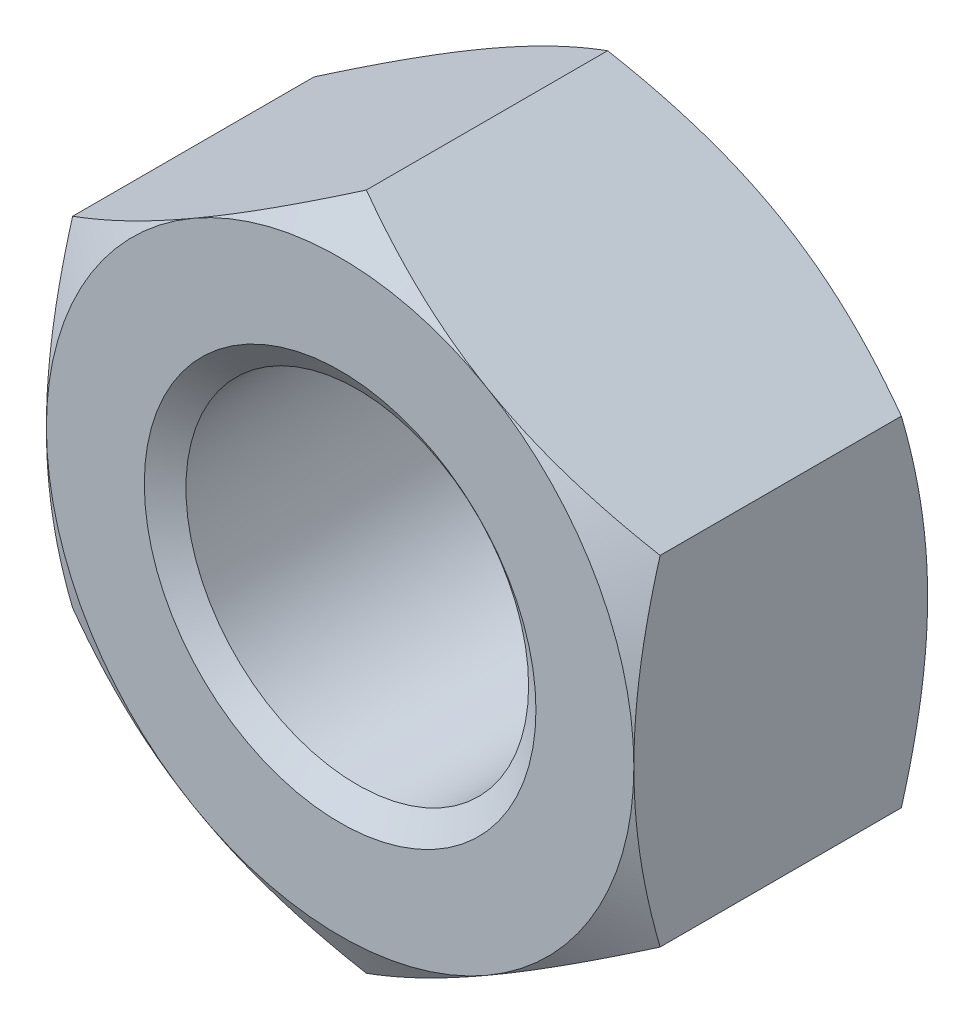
ISO-10303-21;
HEADER;
FILE_DESCRIPTION(('STEP AP214'),'2;1');
FILE_NAME('part.step','',(''),(''),'','','');
FILE_SCHEMA(('AUTOMOTIVE_DESIGN { 1 0 10303 214 1 1 1 1 }'));
ENDSEC;
DATA;
#1=APPLICATION_CONTEXT('core data for automotive mechanical design processes');
#2=APPLICATION_PROTOCOL_DEFINITION('international standard','automotive_design',2000,#1);
#3=PRODUCT_CONTEXT('',#1,'mechanical');
#4=PRODUCT('Part','Part','',(#3));
#5=PRODUCT_RELATED_PRODUCT_CATEGORY('part','',(#4));
#6=PRODUCT_DEFINITION_FORMATION('','',#4);
#7=PRODUCT_DEFINITION_CONTEXT('part definition',#1,'design');
#8=PRODUCT_DEFINITION('design','',#6,#7);
#9=PRODUCT_DEFINITION_SHAPE('','',#8);
#10=(LENGTH_UNIT() NAMED_UNIT(*) SI_UNIT(.MILLI.,.METRE.));
#11=(NAMED_UNIT(*) PLANE_ANGLE_UNIT() SI_UNIT($,.RADIAN.));
#12=(NAMED_UNIT(*) SI_UNIT($,.STERADIAN.) SOLID_ANGLE_UNIT());
#13=UNCERTAINTY_MEASURE_WITH_UNIT(LENGTH_MEASURE(1.E-05),#10,'distance_accuracy_value','');
#14=(GEOMETRIC_REPRESENTATION_CONTEXT(3) GLOBAL_UNCERTAINTY_ASSIGNED_CONTEXT((#13)) GLOBAL_UNIT_ASSIGNED_CONTEXT((#10,
#11,#12)) REPRESENTATION_CONTEXT('',''));
#15=CARTESIAN_POINT('',(0.,0.,0.));
#16=DIRECTION('',(0.,0.,1.));
#17=DIRECTION('',(1.,0.,0.));
#18=AXIS2_PLACEMENT_3D('',#15,#16,#17);
#19=CARTESIAN_POINT('',(0.,0.,-12.));
#20=DIRECTION('',(0.,0.,1.));
#21=DIRECTION('',(1.,0.,0.));
#22=AXIS2_PLACEMENT_3D('',#19,#20,#21);
#23=CYLINDRICAL_SURFACE('',#22,7.);
#24=CARTESIAN_POINT('',(0.,0.,-0.70020753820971));
#25=DIRECTION('',(0.,0.,1.));
#26=DIRECTION('',(1.,0.,0.));
#27=AXIS2_PLACEMENT_3D('',#24,#25,#26);
#28=CIRCLE('',#27,7.);
#29=CARTESIAN_POINT('',(7.,0.,-0.70020753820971));
#30=VERTEX_POINT('',#29);
#31=EDGE_CURVE('E173',#30,#30,#28,.F.);
#32=ORIENTED_EDGE('',*,*,#31,.F.);
#33=EDGE_LOOP('',(#32));
#34=FACE_BOUND('',#33,.T.);
#35=CARTESIAN_POINT('',(0.,0.,-11.2743924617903));
#36=DIRECTION('',(0.,0.,-1.));
#37=DIRECTION('',(-1.,0.,0.));
#38=AXIS2_PLACEMENT_3D('',#35,#36,#37);
#39=CIRCLE('',#38,7.);
#40=CARTESIAN_POINT('',(-7.,0.,-11.2743924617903));
#41=VERTEX_POINT('',#40);
#42=EDGE_CURVE('E37',#41,#41,#39,.F.);
#43=ORIENTED_EDGE('',*,*,#42,.F.);
#44=EDGE_LOOP('',(#43));
#45=FACE_BOUND('',#44,.T.);
#46=ADVANCED_FACE('F32',(#34,#45),#23,.F.);
#47=CARTESIAN_POINT('',(-24.,0.,-12.));
#48=DIRECTION('',(0.,0.,1.));
#49=DIRECTION('',(1.,0.,0.));
#50=AXIS2_PLACEMENT_3D('',#47,#48,#49);
#51=PLANE('',#50);
#52=CARTESIAN_POINT('',(0.,0.,-12.));
#53=DIRECTION('',(0.,0.,1.));
#54=DIRECTION('',(1.,0.,0.));
#55=AXIS2_PLACEMENT_3D('',#52,#53,#54);
#56=CIRCLE('',#55,12.);
#57=CARTESIAN_POINT('',(12.,0.,-12.));
#58=VERTEX_POINT('',#57);
#59=CARTESIAN_POINT('',(6.,10.3923048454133,-12.));
#60=VERTEX_POINT('',#59);
#61=EDGE_CURVE('E243',#58,#60,#56,.T.);
#62=ORIENTED_EDGE('',*,*,#61,.F.);
#63=CARTESIAN_POINT('',(0.,0.,-12.));
#64=DIRECTION('',(0.,0.,1.));
#65=DIRECTION('',(1.,0.,0.));
#66=AXIS2_PLACEMENT_3D('',#63,#64,#65);
#67=CIRCLE('',#66,12.);
#68=CARTESIAN_POINT('',(6.,-10.3923048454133,-12.));
#69=VERTEX_POINT('',#68);
#70=EDGE_CURVE('E167',#58,#69,#67,.F.);
#71=ORIENTED_EDGE('',*,*,#70,.T.);
#72=CARTESIAN_POINT('',(-6.,-10.3923048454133,-12.));
#73=VERTEX_POINT('',#72);
#74=EDGE_CURVE('E169',#69,#73,#67,.F.);
#75=ORIENTED_EDGE('',*,*,#74,.T.);
#76=CARTESIAN_POINT('',(-12.,0.,-12.));
#77=VERTEX_POINT('',#76);
#78=EDGE_CURVE('E400',#73,#77,#67,.F.);
#79=ORIENTED_EDGE('',*,*,#78,.T.);
#80=CARTESIAN_POINT('',(-6.00000000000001,10.3923048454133,-12.));
#81=VERTEX_POINT('',#80);
#82=EDGE_CURVE('E402',#77,#81,#67,.F.);
#83=ORIENTED_EDGE('',*,*,#82,.T.);
#84=EDGE_CURVE('E151',#81,#60,#67,.F.);
#85=ORIENTED_EDGE('',*,*,#84,.T.);
#86=EDGE_LOOP('',(#62,#71,#75,#79,#83,#85));
#87=FACE_BOUND('',#86,.T.);
#88=CARTESIAN_POINT('',(0.,0.,-12.));
#89=DIRECTION('',(0.,0.,1.));
#90=DIRECTION('',(1.,0.,0.));
#91=AXIS2_PLACEMENT_3D('',#88,#89,#90);
#92=CIRCLE('',#91,8.);
#93=CARTESIAN_POINT('',(8.,0.,-12.));
#94=VERTEX_POINT('',#93);
#95=EDGE_CURVE('E176',#94,#94,#92,.F.);
#96=ORIENTED_EDGE('',*,*,#95,.F.);
#97=EDGE_LOOP('',(#96));
#98=FACE_BOUND('',#97,.T.);
#99=ADVANCED_FACE('F295',(#87,#98),#51,.F.);
#100=CARTESIAN_POINT('',(-24.,0.,0.));
#101=DIRECTION('',(0.,0.,1.));
#102=DIRECTION('',(1.,0.,0.));
#103=AXIS2_PLACEMENT_3D('',#100,#101,#102);
#104=PLANE('',#103);
#105=CARTESIAN_POINT('',(0.,0.,0.));
#106=DIRECTION('',(0.,0.,1.));
#107=DIRECTION('',(1.,0.,0.));
#108=AXIS2_PLACEMENT_3D('',#105,#106,#107);
#109=CIRCLE('',#108,12.);
#110=CARTESIAN_POINT('',(6.,-10.3923048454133,0.));
#111=VERTEX_POINT('',#110);
#112=CARTESIAN_POINT('',(12.,0.,0.));
#113=VERTEX_POINT('',#112);
#114=EDGE_CURVE('E44',#111,#113,#109,.T.);
#115=ORIENTED_EDGE('',*,*,#114,.T.);
#116=CARTESIAN_POINT('',(0.,0.,0.));
#117=DIRECTION('',(0.,0.,1.));
#118=DIRECTION('',(1.,0.,0.));
#119=AXIS2_PLACEMENT_3D('',#116,#117,#118);
#120=CIRCLE('',#119,12.);
#121=CARTESIAN_POINT('',(6.,10.3923048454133,0.));
#122=VERTEX_POINT('',#121);
#123=EDGE_CURVE('E51',#113,#122,#120,.T.);
#124=ORIENTED_EDGE('',*,*,#123,.T.);
#125=CARTESIAN_POINT('',(-6.00000000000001,10.3923048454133,0.));
#126=VERTEX_POINT('',#125);
#127=EDGE_CURVE('E11',#122,#126,#109,.T.);
#128=ORIENTED_EDGE('',*,*,#127,.T.);
#129=CARTESIAN_POINT('',(-12.,0.,0.));
#130=VERTEX_POINT('',#129);
#131=EDGE_CURVE('E42',#126,#130,#109,.T.);
#132=ORIENTED_EDGE('',*,*,#131,.T.);
#133=CARTESIAN_POINT('',(-6.,-10.3923048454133,0.));
#134=VERTEX_POINT('',#133);
#135=EDGE_CURVE('E346',#130,#134,#109,.T.);
#136=ORIENTED_EDGE('',*,*,#135,.T.);
#137=EDGE_CURVE('E172',#134,#111,#109,.T.);
#138=ORIENTED_EDGE('',*,*,#137,.T.);
#139=EDGE_LOOP('',(#115,#124,#128,#132,#136,#138));
#140=FACE_BOUND('',#139,.T.);
#141=CARTESIAN_POINT('',(0.,0.,0.));
#142=DIRECTION('',(0.,0.,1.));
#143=DIRECTION('',(1.,0.,0.));
#144=AXIS2_PLACEMENT_3D('',#141,#142,#143);
#145=CIRCLE('',#144,8.);
#146=CARTESIAN_POINT('',(8.,0.,0.));
#147=VERTEX_POINT('',#146);
#148=EDGE_CURVE('E175',#147,#147,#145,.T.);
#149=ORIENTED_EDGE('',*,*,#148,.F.);
#150=EDGE_LOOP('',(#149));
#151=FACE_BOUND('',#150,.T.);
#152=ADVANCED_FACE('F248',(#140,#151),#104,.T.);
#153=CARTESIAN_POINT('',(0.,13.856406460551,-12.));
#154=DIRECTION('',(-0.5,0.866025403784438,0.));
#155=DIRECTION('',(-0.866025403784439,-0.5,0.));
#156=AXIS2_PLACEMENT_3D('',#153,#154,#155);
#157=PLANE('',#156);
#158=DIRECTION('',(0.,0.,1.));
#159=VECTOR('',#158,1.);
#160=CARTESIAN_POINT('',(-12.,6.92820323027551,-12.));
#161=LINE('',#160,#159);
#162=CARTESIAN_POINT('',(-12.,6.92820323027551,-10.9282032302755));
#163=VERTEX_POINT('',#162);
#164=CARTESIAN_POINT('',(-12.,6.92820323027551,-1.07179676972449));
#165=VERTEX_POINT('',#164);
#166=EDGE_CURVE('E163',#163,#165,#161,.T.);
#167=ORIENTED_EDGE('',*,*,#166,.T.);
#168=CARTESIAN_POINT('',(-21.5118521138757,1.43653285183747,-5.5193321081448));
#169=CARTESIAN_POINT('',(-21.2844392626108,1.56782972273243,-5.39338072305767));
#170=CARTESIAN_POINT('',(-21.0567388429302,1.69929262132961,-5.26812197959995));
#171=CARTESIAN_POINT('',(-20.6007016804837,1.96258579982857,-5.01915054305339));
#172=CARTESIAN_POINT('',(-20.3723649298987,2.09441608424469,-4.89543786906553));
#173=CARTESIAN_POINT('',(-19.6862336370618,2.49055417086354,-4.52682005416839));
#174=CARTESIAN_POINT('',(-19.2274007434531,2.75546146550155,-4.28448105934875));
#175=CARTESIAN_POINT('',(-18.3035191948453,3.28886472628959,-3.80680655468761));
#176=CARTESIAN_POINT('',(-17.838449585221,3.55737279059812,-3.57152493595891));
#177=CARTESIAN_POINT('',(-16.904316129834,4.09669499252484,-3.11182292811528));
#178=CARTESIAN_POINT('',(-16.4352525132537,4.36750899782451,-2.8874019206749));
#179=CARTESIAN_POINT('',(-15.4886770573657,4.91401459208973,-2.4506695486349));
#180=CARTESIAN_POINT('',(-15.0111279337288,5.18972770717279,-2.23846529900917));
#181=CARTESIAN_POINT('',(-14.050225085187,5.74450522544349,-1.83201390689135));
#182=CARTESIAN_POINT('',(-13.5668706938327,6.02357001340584,-1.63776884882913));
#183=CARTESIAN_POINT('',(-12.5947392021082,6.58483039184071,-1.27287165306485));
#184=CARTESIAN_POINT('',(-12.1059779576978,6.86701682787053,-1.10216384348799));
#185=CARTESIAN_POINT('',(-11.1215353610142,7.43538502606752,-0.790250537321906));
#186=CARTESIAN_POINT('',(-10.6258564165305,7.72156539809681,-0.649035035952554));
#187=CARTESIAN_POINT('',(-9.62919553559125,8.29698782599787,-0.403852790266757));
#188=CARTESIAN_POINT('',(-9.12823727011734,8.586216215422,-0.299761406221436));
#189=CARTESIAN_POINT('',(-8.37279383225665,9.0223716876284,-0.176422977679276));
#190=CARTESIAN_POINT('',(-8.12027789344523,9.16816183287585,-0.140774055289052));
#191=CARTESIAN_POINT('',(-7.61422458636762,9.46033184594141,-0.0811165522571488));
#192=CARTESIAN_POINT('',(-7.36068731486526,9.6067116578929,-0.057106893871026));
#193=CARTESIAN_POINT('',(-6.85428408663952,9.89908369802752,-0.0213525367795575));
#194=CARTESIAN_POINT('',(-6.60142147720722,10.0450739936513,-0.00954481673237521));
#195=CARTESIAN_POINT('',(-6.09549164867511,10.3371727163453,0.00175778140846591));
#196=CARTESIAN_POINT('',(-5.84242443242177,10.4832811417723,0.00125282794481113));
#197=CARTESIAN_POINT('',(-5.33659437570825,10.77532226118,-0.012058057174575));
#198=CARTESIAN_POINT('',(-5.08383147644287,10.921254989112,-0.0248610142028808));
#199=CARTESIAN_POINT('',(-4.57897206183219,11.2127357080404,-0.0624684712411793));
#200=CARTESIAN_POINT('',(-4.32687558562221,11.358283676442,-0.0872736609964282));
#201=CARTESIAN_POINT('',(-3.70091348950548,11.7196830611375,-0.163275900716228));
#202=CARTESIAN_POINT('',(-3.32767343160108,11.935173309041,-0.221445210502));
#203=CARTESIAN_POINT('',(-2.58441146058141,12.3642958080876,-0.3607187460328));
#204=CARTESIAN_POINT('',(-2.21439010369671,12.5779277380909,-0.441826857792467));
#205=CARTESIAN_POINT('',(-1.47727524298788,13.0035012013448,-0.624209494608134));
#206=CARTESIAN_POINT('',(-1.1101899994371,13.2154379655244,-0.725528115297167));
#207=CARTESIAN_POINT('',(-0.379919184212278,13.6370600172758,-0.945214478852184));
#208=CARTESIAN_POINT('',(-0.0167334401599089,13.8467454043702,-1.06358146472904));
#209=CARTESIAN_POINT('',(0.713618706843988,14.2684144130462,-1.31729223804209));
#210=CARTESIAN_POINT('',(1.08070406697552,14.4803512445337,-1.45294502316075));
#211=CARTESIAN_POINT('',(1.81128558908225,14.9021526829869,-1.73661716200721));
#212=CARTESIAN_POINT('',(2.17478144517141,15.1120171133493,-1.88463755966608));
#213=CARTESIAN_POINT('',(2.89641870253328,15.5286545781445,-2.19000753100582));
#214=CARTESIAN_POINT('',(3.25457893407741,15.7354384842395,-2.34729799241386));
#215=CARTESIAN_POINT('',(3.78961852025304,16.0443437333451,-2.58948854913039));
#216=CARTESIAN_POINT('',(3.96757146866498,16.1470849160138,-2.67124835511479));
#217=CARTESIAN_POINT('',(4.32280423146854,16.3521786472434,-2.83668062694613));
#218=CARTESIAN_POINT('',(4.50008406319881,16.4545312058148,-2.92035304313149));
#219=CARTESIAN_POINT('',(4.67705295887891,16.5567042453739,-3.0048943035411));
#220=B_SPLINE_CURVE_WITH_KNOTS('',3,(#168,#169,#170,#171,#172,#173,#174,#175,#176,#177,#178,
#179,#180,#181,#182,#183,#184,#185,#186,#187,#188,#189,#190,#191,#192,#193,#194,#195,#196,#197,
#198,#199,#200,#201,#202,#203,#204,#205,#206,#207,#208,#209,#210,#211,#212,#213,#214,#215,#216,
#217,#218,#219),.UNSPECIFIED.,.F.,.F.,(4,2,2,2,2,2,2,2,2,2,2,2,2,2,2,2,2,2,2,2,2,2,2,2,2,4),(0.,
0.873710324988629,1.74743143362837,3.49519150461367,5.25398864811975,7.01268554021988,
8.78498817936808,10.5574962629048,12.3257372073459,14.0933773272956,15.8550256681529,
16.736083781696,17.6170602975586,18.4934635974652,19.3698549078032,20.2460342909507,
21.1222640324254,22.4261900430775,23.7303370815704,25.0373612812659,26.3443274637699,
27.6792519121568,29.0142891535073,30.3415803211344,31.0050249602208,31.6684523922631),.UNSPECIFIED.);
#221=EDGE_CURVE('E59',#165,#126,#220,.T.);
#222=ORIENTED_EDGE('',*,*,#221,.T.);
#223=CARTESIAN_POINT('',(0.,13.856406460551,-1.0717967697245));
#224=VERTEX_POINT('',#223);
#225=EDGE_CURVE('E237',#126,#224,#220,.T.);
#226=ORIENTED_EDGE('',*,*,#225,.T.);
#227=DIRECTION('',(0.,0.,1.));
#228=VECTOR('',#227,1.);
#229=CARTESIAN_POINT('',(0.,13.856406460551,-12.));
#230=LINE('',#229,#228);
#231=CARTESIAN_POINT('',(0.,13.856406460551,-10.9282032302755));
#232=VERTEX_POINT('',#231);
#233=EDGE_CURVE('E148',#232,#224,#230,.T.);
#234=ORIENTED_EDGE('',*,*,#233,.F.);
#235=CARTESIAN_POINT('',(-21.5118521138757,1.43653285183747,-6.48066789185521));
#236=CARTESIAN_POINT('',(-21.2844392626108,1.56782972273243,-6.60661927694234));
#237=CARTESIAN_POINT('',(-21.0567388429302,1.6992926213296,-6.73187802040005));
#238=CARTESIAN_POINT('',(-20.6007016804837,1.96258579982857,-6.98084945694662));
#239=CARTESIAN_POINT('',(-20.3723649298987,2.09441608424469,-7.10456213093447));
#240=CARTESIAN_POINT('',(-19.6862336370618,2.49055417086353,-7.47317994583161));
#241=CARTESIAN_POINT('',(-19.2274007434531,2.75546146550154,-7.71551894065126));
#242=CARTESIAN_POINT('',(-18.3035191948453,3.28886472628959,-8.19319344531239));
#243=CARTESIAN_POINT('',(-17.838449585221,3.55737279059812,-8.4284750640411));
#244=CARTESIAN_POINT('',(-16.904316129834,4.09669499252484,-8.88817707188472));
#245=CARTESIAN_POINT('',(-16.4352525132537,4.36750899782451,-9.1125980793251));
#246=CARTESIAN_POINT('',(-15.4886770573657,4.91401459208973,-9.5493304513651));
#247=CARTESIAN_POINT('',(-15.0111279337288,5.18972770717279,-9.76153470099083));
#248=CARTESIAN_POINT('',(-14.050225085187,5.74450522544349,-10.1679860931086));
#249=CARTESIAN_POINT('',(-13.5668706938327,6.02357001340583,-10.3622311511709));
#250=CARTESIAN_POINT('',(-12.5947392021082,6.58483039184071,-10.7271283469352));
#251=CARTESIAN_POINT('',(-12.1059779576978,6.86701682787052,-10.897836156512));
#252=CARTESIAN_POINT('',(-11.1215353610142,7.43538502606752,-11.2097494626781));
#253=CARTESIAN_POINT('',(-10.6258564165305,7.7215653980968,-11.3509649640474));
#254=CARTESIAN_POINT('',(-9.62919553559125,8.29698782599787,-11.5961472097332));
#255=CARTESIAN_POINT('',(-9.12823727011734,8.586216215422,-11.7002385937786));
#256=CARTESIAN_POINT('',(-8.37279383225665,9.0223716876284,-11.8235770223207));
#257=CARTESIAN_POINT('',(-8.12027789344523,9.16816183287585,-11.8592259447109));
#258=CARTESIAN_POINT('',(-7.61422458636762,9.4603318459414,-11.9188834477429));
#259=CARTESIAN_POINT('',(-7.36068731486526,9.6067116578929,-11.942893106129));
#260=CARTESIAN_POINT('',(-6.85428408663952,9.89908369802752,-11.9786474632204));
#261=CARTESIAN_POINT('',(-6.60142147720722,10.0450739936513,-11.9904551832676));
#262=CARTESIAN_POINT('',(-6.09549164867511,10.3371727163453,-12.0017577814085));
#263=CARTESIAN_POINT('',(-5.84242443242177,10.4832811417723,-12.0012528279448));
#264=CARTESIAN_POINT('',(-5.33659437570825,10.77532226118,-11.9879419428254));
#265=CARTESIAN_POINT('',(-5.08383147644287,10.921254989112,-11.9751389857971));
#266=CARTESIAN_POINT('',(-4.57897206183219,11.2127357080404,-11.9375315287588));
#267=CARTESIAN_POINT('',(-4.32687558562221,11.358283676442,-11.9127263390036));
#268=CARTESIAN_POINT('',(-3.70091348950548,11.7196830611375,-11.8367240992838));
#269=CARTESIAN_POINT('',(-3.32767343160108,11.935173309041,-11.778554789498));
#270=CARTESIAN_POINT('',(-2.58441146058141,12.3642958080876,-11.6392812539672));
#271=CARTESIAN_POINT('',(-2.21439010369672,12.5779277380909,-11.5581731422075));
#272=CARTESIAN_POINT('',(-1.47727524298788,13.0035012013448,-11.3757905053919));
#273=CARTESIAN_POINT('',(-1.11018999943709,13.2154379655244,-11.2744718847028));
#274=CARTESIAN_POINT('',(-0.379919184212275,13.6370600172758,-11.0547855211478));
#275=CARTESIAN_POINT('',(-0.0167334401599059,13.8467454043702,-10.936418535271));
#276=CARTESIAN_POINT('',(0.713618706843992,14.2684144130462,-10.6827077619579));
#277=CARTESIAN_POINT('',(1.08070406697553,14.4803512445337,-10.5470549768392));
#278=CARTESIAN_POINT('',(1.81128558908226,14.902152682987,-10.2633828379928));
#279=CARTESIAN_POINT('',(2.17478144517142,15.1120171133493,-10.1153624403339));
#280=CARTESIAN_POINT('',(2.89641870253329,15.5286545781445,-9.80999246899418));
#281=CARTESIAN_POINT('',(3.25457893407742,15.7354384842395,-9.65270200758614));
#282=CARTESIAN_POINT('',(3.78961852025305,16.0443437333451,-9.41051145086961));
#283=CARTESIAN_POINT('',(3.96757146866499,16.1470849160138,-9.32875164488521));
#284=CARTESIAN_POINT('',(4.32280423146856,16.3521786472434,-9.16331937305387));
#285=CARTESIAN_POINT('',(4.50008406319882,16.4545312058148,-9.07964695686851));
#286=CARTESIAN_POINT('',(4.67705295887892,16.5567042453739,-8.9951056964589));
#287=B_SPLINE_CURVE_WITH_KNOTS('',3,(#235,#236,#237,#238,#239,#240,#241,#242,#243,#244,#245,
#246,#247,#248,#249,#250,#251,#252,#253,#254,#255,#256,#257,#258,#259,#260,#261,#262,#263,#264,
#265,#266,#267,#268,#269,#270,#271,#272,#273,#274,#275,#276,#277,#278,#279,#280,#281,#282,#283,
#284,#285,#286),.UNSPECIFIED.,.F.,.F.,(4,2,2,2,2,2,2,2,2,2,2,2,2,2,2,2,2,2,2,2,2,2,2,2,2,4),(0.,
0.873710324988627,1.74743143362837,3.49519150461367,5.25398864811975,7.01268554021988,
8.78498817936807,10.5574962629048,12.3257372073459,14.0933773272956,15.8550256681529,
16.736083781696,17.6170602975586,18.4934635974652,19.3698549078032,20.2460342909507,
21.1222640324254,22.4261900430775,23.7303370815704,25.0373612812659,26.3443274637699,
27.6792519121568,29.0142891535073,30.3415803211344,31.0050249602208,31.6684523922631),.UNSPECIFIED.);
#288=EDGE_CURVE('E166',#81,#232,#287,.T.);
#289=ORIENTED_EDGE('',*,*,#288,.F.);
#290=EDGE_CURVE('E258',#163,#81,#287,.T.);
#291=ORIENTED_EDGE('',*,*,#290,.F.);
#292=EDGE_LOOP('',(#167,#222,#226,#234,#289,#291));
#293=FACE_BOUND('',#292,.T.);
#294=ADVANCED_FACE('F34',(#293),#157,.T.);
#295=CARTESIAN_POINT('',(12.,6.92820323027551,-12.));
#296=DIRECTION('',(0.5,0.866025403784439,0.));
#297=DIRECTION('',(-0.866025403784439,0.5,0.));
#298=AXIS2_PLACEMENT_3D('',#295,#296,#297);
#299=PLANE('',#298);
#300=ORIENTED_EDGE('',*,*,#233,.T.);
#301=CARTESIAN_POINT('',(-1.59839190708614,14.7792384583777,-1.65435167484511));
#302=CARTESIAN_POINT('',(-1.30356603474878,14.6090206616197,-1.53837115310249));
#303=CARTESIAN_POINT('',(-1.00755843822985,14.4381205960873,-1.42627106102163));
#304=CARTESIAN_POINT('',(-0.412942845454,14.0948191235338,-1.2112251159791));
#305=CARTESIAN_POINT('',(-0.114333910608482,13.9224171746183,-1.10828273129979));
#306=CARTESIAN_POINT('',(0.486744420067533,13.5753844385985,-0.912629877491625));
#307=CARTESIAN_POINT('',(0.789224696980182,13.4007473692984,-0.819963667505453));
#308=CARTESIAN_POINT('',(1.39681179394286,13.0499567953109,-0.64701620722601));
#309=CARTESIAN_POINT('',(1.70191833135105,12.8738034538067,-0.566733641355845));
#310=CARTESIAN_POINT('',(2.3051840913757,12.5255078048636,-0.422530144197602));
#311=CARTESIAN_POINT('',(2.60326575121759,12.3534102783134,-0.358179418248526));
#312=CARTESIAN_POINT('',(3.20156039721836,12.0079847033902,-0.244247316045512));
#313=CARTESIAN_POINT('',(3.50177341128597,11.834656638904,-0.194666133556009));
#314=CARTESIAN_POINT('',(4.10330495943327,11.4873622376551,-0.1117164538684));
#315=CARTESIAN_POINT('',(4.40462026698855,11.3133977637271,-0.078317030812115));
#316=CARTESIAN_POINT('',(5.00830878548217,10.9648580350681,-0.0286084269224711));
#317=CARTESIAN_POINT('',(5.31068196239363,10.7902827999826,-0.0122987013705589));
#318=CARTESIAN_POINT('',(5.89811964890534,10.4511254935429,0.00226788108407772));
#319=CARTESIAN_POINT('',(6.18316577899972,10.2865540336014,0.00152155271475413));
#320=CARTESIAN_POINT('',(6.75290441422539,9.95761527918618,-0.0155669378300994));
#321=CARTESIAN_POINT('',(7.03759691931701,9.79324798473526,-0.0319091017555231));
#322=CARTESIAN_POINT('',(7.60648327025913,9.46480129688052,-0.0797616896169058));
#323=CARTESIAN_POINT('',(7.8906755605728,9.30072280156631,-0.111296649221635));
#324=CARTESIAN_POINT('',(8.45756487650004,8.973429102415,-0.188680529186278));
#325=CARTESIAN_POINT('',(8.74026191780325,8.81021388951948,-0.234529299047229));
#326=CARTESIAN_POINT('',(9.60228432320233,8.31252502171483,-0.395013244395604));
#327=CARTESIAN_POINT('',(10.1786875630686,7.97973845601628,-0.531073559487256));
#328=CARTESIAN_POINT('',(11.0351599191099,7.48525391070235,-0.768415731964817));
#329=CARTESIAN_POINT('',(11.3189025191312,7.32143504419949,-0.852929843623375));
#330=CARTESIAN_POINT('',(11.8839381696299,6.99521155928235,-1.03167367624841));
#331=CARTESIAN_POINT('',(12.1652323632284,6.83280628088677,-1.12589856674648));
#332=CARTESIAN_POINT('',(12.4454333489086,6.67103216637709,-1.22433178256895));
#333=B_SPLINE_CURVE_WITH_KNOTS('',3,(#301,#302,#303,#304,#305,#306,#307,#308,#309,#310,#311,
#312,#313,#314,#315,#316,#317,#318,#319,#320,#321,#322,#323,#324,#325,#326,#327,#328,#329,#330,
#331,#332),.UNSPECIFIED.,.F.,.F.,(4,2,2,2,2,2,2,2,2,2,2,2,2,2,2,4),(0.,1.07898561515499,
2.15837814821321,3.24225247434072,4.32601157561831,5.37619931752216,6.426400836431,
7.4745872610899,8.52274027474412,9.5098010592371,10.4968619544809,11.4855222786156,
12.4741722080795,14.5098421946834,15.5248305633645,16.5393164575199),.UNSPECIFIED.);
#334=EDGE_CURVE('E141',#224,#122,#333,.T.);
#335=ORIENTED_EDGE('',*,*,#334,.T.);
#336=CARTESIAN_POINT('',(12.,6.92820323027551,-1.0717967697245));
#337=VERTEX_POINT('',#336);
#338=EDGE_CURVE('E127',#122,#337,#333,.T.);
#339=ORIENTED_EDGE('',*,*,#338,.T.);
#340=DIRECTION('',(0.,0.,1.));
#341=VECTOR('',#340,1.);
#342=CARTESIAN_POINT('',(12.,6.92820323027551,-12.));
#343=LINE('',#342,#341);
#344=CARTESIAN_POINT('',(12.,6.92820323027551,-10.9282032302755));
#345=VERTEX_POINT('',#344);
#346=EDGE_CURVE('E140',#345,#337,#343,.T.);
#347=ORIENTED_EDGE('',*,*,#346,.F.);
#348=CARTESIAN_POINT('',(-1.59839190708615,14.7792384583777,-10.3456483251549));
#349=CARTESIAN_POINT('',(-1.30356603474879,14.6090206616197,-10.4616288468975));
#350=CARTESIAN_POINT('',(-1.00755843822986,14.4381205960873,-10.5737289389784));
#351=CARTESIAN_POINT('',(-0.412942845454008,14.0948191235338,-10.7887748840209));
#352=CARTESIAN_POINT('',(-0.11433391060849,13.9224171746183,-10.8917172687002));
#353=CARTESIAN_POINT('',(0.486744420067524,13.5753844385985,-11.0873701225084));
#354=CARTESIAN_POINT('',(0.789224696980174,13.4007473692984,-11.1800363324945));
#355=CARTESIAN_POINT('',(1.39681179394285,13.0499567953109,-11.352983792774));
#356=CARTESIAN_POINT('',(1.70191833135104,12.8738034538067,-11.4332663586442));
#357=CARTESIAN_POINT('',(2.30518409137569,12.5255078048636,-11.5774698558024));
#358=CARTESIAN_POINT('',(2.60326575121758,12.3534102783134,-11.6418205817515));
#359=CARTESIAN_POINT('',(3.20156039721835,12.0079847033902,-11.7557526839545));
#360=CARTESIAN_POINT('',(3.50177341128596,11.834656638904,-11.805333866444));
#361=CARTESIAN_POINT('',(4.10330495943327,11.4873622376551,-11.8882835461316));
#362=CARTESIAN_POINT('',(4.40462026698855,11.3133977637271,-11.9216829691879));
#363=CARTESIAN_POINT('',(5.00830878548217,10.9648580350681,-11.9713915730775));
#364=CARTESIAN_POINT('',(5.31068196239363,10.7902827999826,-11.9877012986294));
#365=CARTESIAN_POINT('',(5.89811964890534,10.4511254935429,-12.0022678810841));
#366=CARTESIAN_POINT('',(6.18316577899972,10.2865540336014,-12.0015215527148));
#367=CARTESIAN_POINT('',(6.7529044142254,9.95761527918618,-11.9844330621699));
#368=CARTESIAN_POINT('',(7.03759691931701,9.79324798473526,-11.9680908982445));
#369=CARTESIAN_POINT('',(7.60648327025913,9.46480129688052,-11.9202383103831));
#370=CARTESIAN_POINT('',(7.8906755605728,9.30072280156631,-11.8887033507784));
#371=CARTESIAN_POINT('',(8.45756487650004,8.973429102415,-11.8113194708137));
#372=CARTESIAN_POINT('',(8.74026191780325,8.81021388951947,-11.7654707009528));
#373=CARTESIAN_POINT('',(9.60228432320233,8.31252502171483,-11.6049867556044));
#374=CARTESIAN_POINT('',(10.1786875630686,7.97973845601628,-11.4689264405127));
#375=CARTESIAN_POINT('',(11.0351599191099,7.48525391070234,-11.2315842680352));
#376=CARTESIAN_POINT('',(11.3189025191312,7.32143504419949,-11.1470701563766));
#377=CARTESIAN_POINT('',(11.8839381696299,6.99521155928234,-10.9683263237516));
#378=CARTESIAN_POINT('',(12.1652323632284,6.83280628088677,-10.8741014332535));
#379=CARTESIAN_POINT('',(12.4454333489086,6.67103216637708,-10.775668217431));
#380=B_SPLINE_CURVE_WITH_KNOTS('',3,(#348,#349,#350,#351,#352,#353,#354,#355,#356,#357,#358,
#359,#360,#361,#362,#363,#364,#365,#366,#367,#368,#369,#370,#371,#372,#373,#374,#375,#376,#377,
#378,#379),.UNSPECIFIED.,.F.,.F.,(4,2,2,2,2,2,2,2,2,2,2,2,2,2,2,4),(0.,1.078985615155,
2.15837814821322,3.24225247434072,4.32601157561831,5.37619931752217,6.42640083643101,
7.47458726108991,8.52274027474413,9.50980105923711,10.4968619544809,11.4855222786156,
12.4741722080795,14.5098421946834,15.5248305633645,16.5393164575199),.UNSPECIFIED.);
#381=EDGE_CURVE('E252',#60,#345,#380,.T.);
#382=ORIENTED_EDGE('',*,*,#381,.F.);
#383=EDGE_CURVE('E257',#232,#60,#380,.T.);
#384=ORIENTED_EDGE('',*,*,#383,.F.);
#385=EDGE_LOOP('',(#300,#335,#339,#347,#382,#384));
#386=FACE_BOUND('',#385,.T.);
#387=ADVANCED_FACE('F138',(#386),#299,.T.);
#388=CARTESIAN_POINT('',(12.,6.92820323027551,-12.));
#389=DIRECTION('',(-1.,0.,0.));
#390=DIRECTION('',(0.,0.,1.));
#391=AXIS2_PLACEMENT_3D('',#388,#389,#390);
#392=PLANE('',#391);
#393=CARTESIAN_POINT('',(12.,-18.3746159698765,-5.74232046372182));
#394=CARTESIAN_POINT('',(12.,-18.1111918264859,-5.61498513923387));
#395=CARTESIAN_POINT('',(12.,-17.8474492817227,-5.48830883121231));
#396=CARTESIAN_POINT('',(12.,-17.3192601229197,-5.23642551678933));
#397=CARTESIAN_POINT('',(12.,-17.0548135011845,-5.11121852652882));
#398=CARTESIAN_POINT('',(12.,-16.2602391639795,-4.73799215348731));
#399=CARTESIAN_POINT('',(12.,-15.7289626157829,-4.49240888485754));
#400=CARTESIAN_POINT('',(12.,-14.659698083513,-4.00791887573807));
#401=CARTESIAN_POINT('',(12.,-14.1216890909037,-3.76905838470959));
#402=CARTESIAN_POINT('',(12.,-13.0412497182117,-3.30159295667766));
#403=CARTESIAN_POINT('',(12.,-12.4988195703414,-3.07298748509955));
#404=CARTESIAN_POINT('',(12.,-11.4019415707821,-2.62605165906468));
#405=CARTESIAN_POINT('',(12.,-10.8474279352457,-2.407881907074));
#406=CARTESIAN_POINT('',(12.,-9.73185625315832,-1.98862863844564));
#407=CARTESIAN_POINT('',(12.,-9.17079748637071,-1.78754702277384));
#408=CARTESIAN_POINT('',(12.,-8.04241377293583,-1.40787575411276));
#409=CARTESIAN_POINT('',(12.,-7.47510504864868,-1.22923828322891));
#410=CARTESIAN_POINT('',(12.,-6.3323679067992,-0.900248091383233));
#411=CARTESIAN_POINT('',(12.,-5.75694211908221,-0.749886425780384));
#412=CARTESIAN_POINT('',(12.,-4.88760620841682,-0.551055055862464));
#413=CARTESIAN_POINT('',(12.,-4.59673300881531,-0.489219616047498));
#414=CARTESIAN_POINT('',(12.,-4.01305048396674,-0.375428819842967));
#415=CARTESIAN_POINT('',(12.,-3.72024120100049,-0.323473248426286));
#416=CARTESIAN_POINT('',(12.,-3.13287727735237,-0.230362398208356));
#417=CARTESIAN_POINT('',(12.,-2.83832249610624,-0.189208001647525));
#418=CARTESIAN_POINT('',(12.,-2.24782315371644,-0.118528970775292));
#419=CARTESIAN_POINT('',(12.,-1.95187864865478,-0.0890038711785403));
#420=CARTESIAN_POINT('',(12.,-1.36089234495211,-0.0423753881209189));
#421=CARTESIAN_POINT('',(12.,-1.06585670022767,-0.0251945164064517));
#422=CARTESIAN_POINT('',(12.,-0.475323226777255,-0.00334573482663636));
#423=CARTESIAN_POINT('',(12.,-0.179825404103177,0.00132233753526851));
#424=CARTESIAN_POINT('',(12.,0.411018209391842,-0.0019652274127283));
#425=CARTESIAN_POINT('',(12.,0.706364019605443,-0.00991732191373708));
#426=CARTESIAN_POINT('',(12.,1.29646300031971,-0.0382476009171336));
#427=CARTESIAN_POINT('',(12.,1.59121614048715,-0.058626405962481));
#428=CARTESIAN_POINT('',(12.,2.30560702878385,-0.122652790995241));
#429=CARTESIAN_POINT('',(12.,2.72469590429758,-0.172526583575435));
#430=CARTESIAN_POINT('',(12.,3.55966217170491,-0.294627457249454));
#431=CARTESIAN_POINT('',(12.,3.97553865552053,-0.366860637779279));
#432=CARTESIAN_POINT('',(12.,4.80373712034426,-0.531118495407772));
#433=CARTESIAN_POINT('',(12.,5.2160553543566,-0.623161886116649));
#434=CARTESIAN_POINT('',(12.,6.03644960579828,-0.824231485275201));
#435=CARTESIAN_POINT('',(12.,6.44452601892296,-0.933256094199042));
#436=CARTESIAN_POINT('',(12.,7.26648771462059,-1.16853096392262));
#437=CARTESIAN_POINT('',(12.,7.68027019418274,-1.29513795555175));
#438=CARTESIAN_POINT('',(12.,8.50346065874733,-1.56085760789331));
#439=CARTESIAN_POINT('',(12.,8.91287144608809,-1.69996164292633));
#440=CARTESIAN_POINT('',(12.,9.72567950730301,-1.98781971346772));
#441=CARTESIAN_POINT('',(12.,10.1290976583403,-2.13651502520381));
#442=CARTESIAN_POINT('',(12.,10.7318330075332,-2.3660506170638));
#443=CARTESIAN_POINT('',(12.,10.9323890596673,-2.44366199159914));
#444=CARTESIAN_POINT('',(12.,11.3327210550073,-2.60085858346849));
#445=CARTESIAN_POINT('',(12.,11.5324970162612,-2.68044375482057));
#446=CARTESIAN_POINT('',(12.,11.7319109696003,-2.76092701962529));
#447=B_SPLINE_CURVE_WITH_KNOTS('',3,(#393,#394,#395,#396,#397,#398,#399,#400,#401,#402,#403,
#404,#405,#406,#407,#408,#409,#410,#411,#412,#413,#414,#415,#416,#417,#418,#419,#420,#421,#422,
#423,#424,#425,#426,#427,#428,#429,#430,#431,#432,#433,#434,#435,#436,#437,#438,#439,#440,#441,
#442,#443,#444,#445,#446),.UNSPECIFIED.,.F.,.F.,(4,2,2,2,2,2,2,2,2,2,2,2,2,2,2,2,2,2,2,2,2,2,2,
2,2,2,4),(0.,0.877756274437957,1.75552218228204,3.51133949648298,5.2772046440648,
7.04297763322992,8.83042883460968,10.6180786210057,12.4018527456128,14.1850616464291,
15.0770405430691,15.9690000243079,16.861032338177,17.7530289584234,18.63937614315,
19.5257118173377,20.4117987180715,21.2979298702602,22.5633628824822,23.8291413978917,
25.0961209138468,26.3629811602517,27.6608948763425,28.9579195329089,30.2476436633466,
30.8927835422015,31.5379084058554),.UNSPECIFIED.);
#448=CARTESIAN_POINT('',(12.,-6.92820323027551,-1.0717967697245));
#449=VERTEX_POINT('',#448);
#450=EDGE_CURVE('E133',#449,#113,#447,.T.);
#451=ORIENTED_EDGE('',*,*,#450,.F.);
#452=DIRECTION('',(0.,0.,1.));
#453=VECTOR('',#452,1.);
#454=CARTESIAN_POINT('',(12.,-6.92820323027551,-12.));
#455=LINE('',#454,#453);
#456=CARTESIAN_POINT('',(12.,-6.92820323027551,-10.9282032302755));
#457=VERTEX_POINT('',#456);
#458=EDGE_CURVE('E149',#457,#449,#455,.T.);
#459=ORIENTED_EDGE('',*,*,#458,.F.);
#460=CARTESIAN_POINT('',(12.,-18.3746159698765,-6.25767953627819));
#461=CARTESIAN_POINT('',(12.,-18.1111918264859,-6.38501486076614));
#462=CARTESIAN_POINT('',(12.,-17.8474492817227,-6.5116911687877));
#463=CARTESIAN_POINT('',(12.,-17.3192601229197,-6.76357448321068));
#464=CARTESIAN_POINT('',(12.,-17.0548135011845,-6.88878147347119));
#465=CARTESIAN_POINT('',(12.,-16.2602391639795,-7.2620078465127));
#466=CARTESIAN_POINT('',(12.,-15.7289626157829,-7.50759111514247));
#467=CARTESIAN_POINT('',(12.,-14.659698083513,-7.99208112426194));
#468=CARTESIAN_POINT('',(12.,-14.1216890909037,-8.23094161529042));
#469=CARTESIAN_POINT('',(12.,-13.0412497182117,-8.69840704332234));
#470=CARTESIAN_POINT('',(12.,-12.4988195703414,-8.92701251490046));
#471=CARTESIAN_POINT('',(12.,-11.4019415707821,-9.37394834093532));
#472=CARTESIAN_POINT('',(12.,-10.8474279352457,-9.59211809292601));
#473=CARTESIAN_POINT('',(12.,-9.73185625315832,-10.0113713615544));
#474=CARTESIAN_POINT('',(12.,-9.17079748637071,-10.2124529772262));
#475=CARTESIAN_POINT('',(12.,-8.04241377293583,-10.5921242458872));
#476=CARTESIAN_POINT('',(12.,-7.47510504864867,-10.7707617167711));
#477=CARTESIAN_POINT('',(12.,-6.33236790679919,-11.0997519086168));
#478=CARTESIAN_POINT('',(12.,-5.75694211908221,-11.2501135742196));
#479=CARTESIAN_POINT('',(12.,-4.88760620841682,-11.4489449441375));
#480=CARTESIAN_POINT('',(12.,-4.5967330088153,-11.5107803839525));
#481=CARTESIAN_POINT('',(12.,-4.01305048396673,-11.624571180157));
#482=CARTESIAN_POINT('',(12.,-3.72024120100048,-11.6765267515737));
#483=CARTESIAN_POINT('',(12.,-3.13287727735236,-11.7696376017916));
#484=CARTESIAN_POINT('',(12.,-2.83832249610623,-11.8107919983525));
#485=CARTESIAN_POINT('',(12.,-2.24782315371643,-11.8814710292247));
#486=CARTESIAN_POINT('',(12.,-1.95187864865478,-11.9109961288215));
#487=CARTESIAN_POINT('',(12.,-1.3608923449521,-11.9576246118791));
#488=CARTESIAN_POINT('',(12.,-1.06585670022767,-11.9748054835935));
#489=CARTESIAN_POINT('',(12.,-0.475323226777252,-11.9966542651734));
#490=CARTESIAN_POINT('',(12.,-0.179825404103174,-12.0013223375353));
#491=CARTESIAN_POINT('',(12.,0.411018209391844,-11.9980347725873));
#492=CARTESIAN_POINT('',(12.,0.706364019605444,-11.9900826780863));
#493=CARTESIAN_POINT('',(12.,1.2964630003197,-11.9617523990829));
#494=CARTESIAN_POINT('',(12.,1.59121614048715,-11.9413735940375));
#495=CARTESIAN_POINT('',(12.,2.30560702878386,-11.8773472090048));
#496=CARTESIAN_POINT('',(12.,2.72469590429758,-11.8274734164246));
#497=CARTESIAN_POINT('',(12.,3.55966217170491,-11.7053725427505));
#498=CARTESIAN_POINT('',(12.,3.97553865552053,-11.6331393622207));
#499=CARTESIAN_POINT('',(12.,4.80373712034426,-11.4688815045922));
#500=CARTESIAN_POINT('',(12.,5.21605535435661,-11.3768381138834));
#501=CARTESIAN_POINT('',(12.,6.03644960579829,-11.1757685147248));
#502=CARTESIAN_POINT('',(12.,6.44452601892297,-11.066743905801));
#503=CARTESIAN_POINT('',(12.,7.2664877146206,-10.8314690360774));
#504=CARTESIAN_POINT('',(12.,7.68027019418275,-10.7048620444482));
#505=CARTESIAN_POINT('',(12.,8.50346065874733,-10.4391423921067));
#506=CARTESIAN_POINT('',(12.,8.91287144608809,-10.3000383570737));
#507=CARTESIAN_POINT('',(12.,9.72567950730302,-10.0121802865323));
#508=CARTESIAN_POINT('',(12.,10.1290976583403,-9.86348497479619));
#509=CARTESIAN_POINT('',(12.,10.7318330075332,-9.6339493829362));
#510=CARTESIAN_POINT('',(12.,10.9323890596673,-9.55633800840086));
#511=CARTESIAN_POINT('',(12.,11.3327210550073,-9.39914141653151));
#512=CARTESIAN_POINT('',(12.,11.5324970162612,-9.31955624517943));
#513=CARTESIAN_POINT('',(12.,11.7319109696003,-9.23907298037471));
#514=B_SPLINE_CURVE_WITH_KNOTS('',3,(#460,#461,#462,#463,#464,#465,#466,#467,#468,#469,#470,
#471,#472,#473,#474,#475,#476,#477,#478,#479,#480,#481,#482,#483,#484,#485,#486,#487,#488,#489,
#490,#491,#492,#493,#494,#495,#496,#497,#498,#499,#500,#501,#502,#503,#504,#505,#506,#507,#508,
#509,#510,#511,#512,#513),.UNSPECIFIED.,.F.,.F.,(4,2,2,2,2,2,2,2,2,2,2,2,2,2,2,2,2,2,2,2,2,2,2,
2,2,2,4),(0.,0.877756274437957,1.75552218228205,3.51133949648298,5.27720464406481,
7.04297763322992,8.83042883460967,10.6180786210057,12.4018527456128,14.1850616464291,
15.0770405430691,15.9690000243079,16.861032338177,17.7530289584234,18.63937614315,
19.5257118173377,20.4117987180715,21.2979298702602,22.5633628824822,23.8291413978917,
25.0961209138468,26.3629811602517,27.6608948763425,28.9579195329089,30.2476436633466,
30.8927835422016,31.5379084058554),.UNSPECIFIED.);
#515=EDGE_CURVE('E263',#457,#58,#514,.T.);
#516=ORIENTED_EDGE('',*,*,#515,.T.);
#517=EDGE_CURVE('E147',#58,#345,#514,.T.);
#518=ORIENTED_EDGE('',*,*,#517,.T.);
#519=ORIENTED_EDGE('',*,*,#346,.T.);
#520=EDGE_CURVE('E124',#113,#337,#447,.T.);
#521=ORIENTED_EDGE('',*,*,#520,.F.);
#522=EDGE_LOOP('',(#451,#459,#516,#518,#519,#521));
#523=FACE_BOUND('',#522,.T.);
#524=ADVANCED_FACE('F144',(#523),#392,.F.);
#525=CARTESIAN_POINT('',(0.,-13.856406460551,-12.));
#526=DIRECTION('',(0.5,-0.866025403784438,0.));
#527=DIRECTION('',(0.866025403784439,0.5,0.));
#528=AXIS2_PLACEMENT_3D('',#525,#526,#527);
#529=PLANE('',#528);
#530=ORIENTED_EDGE('',*,*,#458,.T.);
#531=CARTESIAN_POINT('',(-9.51203383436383,-19.3481817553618,-5.51943275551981));
#532=CARTESIAN_POINT('',(-9.28462157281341,-19.2168852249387,-5.39348123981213));
#533=CARTESIAN_POINT('',(-9.05692175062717,-19.085422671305,-5.26822234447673));
#534=CARTESIAN_POINT('',(-8.60088580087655,-18.8221301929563,-5.01925055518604));
#535=CARTESIAN_POINT('',(-8.37254966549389,-18.6903002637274,-4.89553768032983));
#536=CARTESIAN_POINT('',(-7.68642025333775,-18.2941632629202,-4.52691918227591));
#537=CARTESIAN_POINT('',(-7.22758865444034,-18.029256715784,-4.28457962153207));
#538=CARTESIAN_POINT('',(-6.3037099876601,-17.4958551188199,-3.80690378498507));
#539=CARTESIAN_POINT('',(-5.83864196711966,-17.2273479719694,-3.57162139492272));
#540=CARTESIAN_POINT('',(-4.9045118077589,-16.6880276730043,-3.11191743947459));
#541=CARTESIAN_POINT('',(-4.43544989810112,-16.4172146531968,-2.88749525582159));
#542=CARTESIAN_POINT('',(-3.48887677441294,-15.8707104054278,-2.45075941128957));
#543=CARTESIAN_POINT('',(-3.0113282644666,-15.5949976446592,-2.23855289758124));
#544=CARTESIAN_POINT('',(-2.05042676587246,-15.0402209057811,-1.83209635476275));
#545=CARTESIAN_POINT('',(-1.56707311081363,-14.7611565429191,-1.63784840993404));
#546=CARTESIAN_POINT('',(-0.594943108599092,-14.1998970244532,-1.2729446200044));
#547=CARTESIAN_POINT('',(-0.106182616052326,-13.9177110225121,-1.10223310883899));
#548=CARTESIAN_POINT('',(0.878258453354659,-13.3493437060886,-0.790311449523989));
#549=CARTESIAN_POINT('',(1.37393662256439,-13.063163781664,-0.649091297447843));
#550=CARTESIAN_POINT('',(2.37059933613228,-12.4877402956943,-0.403897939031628));
#551=CARTESIAN_POINT('',(2.87156025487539,-12.1985103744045,-0.299800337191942));
#552=CARTESIAN_POINT('',(3.62700793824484,-11.7623524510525,-0.176452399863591));
#553=CARTESIAN_POINT('',(3.87952533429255,-11.6165614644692,-0.140800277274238));
#554=CARTESIAN_POINT('',(4.38558165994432,-11.3243897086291,-0.0811363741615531));
#555=CARTESIAN_POINT('',(4.63912049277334,-11.1780089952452,-0.0571235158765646));
#556=CARTESIAN_POINT('',(5.14552679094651,-10.8856351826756,-0.0213628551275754));
#557=CARTESIAN_POINT('',(5.39839090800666,-10.7396440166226,-0.00955202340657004));
#558=CARTESIAN_POINT('',(5.90432386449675,-10.4475434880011,0.00175667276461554));
#559=CARTESIAN_POINT('',(6.15739270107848,-10.3014341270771,0.00125470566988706));
#560=CARTESIAN_POINT('',(6.66322609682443,-10.0093910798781,-0.0120504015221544));
#561=CARTESIAN_POINT('',(6.9159907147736,-9.86345735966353,-0.0248505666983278));
#562=CARTESIAN_POINT('',(7.4208536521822,-9.57197460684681,-0.0624526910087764));
#563=CARTESIAN_POINT('',(7.67295193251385,-9.42642559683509,-0.0872553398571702));
#564=CARTESIAN_POINT('',(8.29890926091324,-9.06502896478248,-0.163250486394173));
#565=CARTESIAN_POINT('',(8.67214284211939,-8.84954245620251,-0.221414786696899));
#566=CARTESIAN_POINT('',(9.41539209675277,-8.42042729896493,-0.360677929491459));
#567=CARTESIAN_POINT('',(9.78540721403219,-8.20679897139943,-0.441780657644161));
#568=CARTESIAN_POINT('',(10.5225097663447,-7.78123261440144,-0.624152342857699));
#569=CARTESIAN_POINT('',(10.8895889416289,-7.5692993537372,-0.725465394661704));
#570=CARTESIAN_POINT('',(11.6198477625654,-7.14768422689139,-0.945140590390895));
#571=CARTESIAN_POINT('',(11.9830275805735,-6.93800226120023,-1.06350197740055));
#572=CARTESIAN_POINT('',(12.7133682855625,-6.51633985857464,-1.31720164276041));
#573=CARTESIAN_POINT('',(13.0804481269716,-6.30440621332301,-1.45284893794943));
#574=CARTESIAN_POINT('',(13.8110186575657,-5.8826111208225,-1.73651022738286));
#575=CARTESIAN_POINT('',(14.1745090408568,-5.67274985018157,-1.88452526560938));
#576=CARTESIAN_POINT('',(14.8961354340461,-5.25611865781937,-2.18988470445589));
#577=CARTESIAN_POINT('',(15.2542902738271,-5.04933786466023,-2.34716999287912));
#578=CARTESIAN_POINT('',(15.7893217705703,-4.74043728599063,-2.58935289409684));
#579=CARTESIAN_POINT('',(15.967272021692,-4.63769766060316,-2.67111016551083));
#580=CARTESIAN_POINT('',(16.3224993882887,-4.43260704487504,-2.83653740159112));
#581=CARTESIAN_POINT('',(16.4997765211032,-4.3302560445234,-2.92020731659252));
#582=CARTESIAN_POINT('',(16.6767427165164,-4.22808456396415,-3.00474609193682));
#583=B_SPLINE_CURVE_WITH_KNOTS('',3,(#531,#532,#533,#534,#535,#536,#537,#538,#539,#540,#541,
#542,#543,#544,#545,#546,#547,#548,#549,#550,#551,#552,#553,#554,#555,#556,#557,#558,#559,#560,
#561,#562,#563,#564,#565,#566,#567,#568,#569,#570,#571,#572,#573,#574,#575,#576,#577,#578,#579,
#580,#581,#582),.UNSPECIFIED.,.F.,.F.,(4,2,2,2,2,2,2,2,2,2,2,2,2,2,2,2,2,2,2,2,2,2,2,2,2,4),(0.,
0.873708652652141,1.74742808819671,3.49518479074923,5.2539778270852,7.01267061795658,
8.78497372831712,10.5574822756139,12.3257239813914,14.0933648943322,15.8550256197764,
16.7360899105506,17.6170726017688,18.4934814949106,19.3698783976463,20.2460633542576,
21.1222986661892,22.4262004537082,23.7303232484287,25.0373231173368,26.3442649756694,
27.6791661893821,29.0141801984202,30.3414483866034,31.0048815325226,31.6682974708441),.UNSPECIFIED.);
#584=EDGE_CURVE('E334',#449,#111,#583,.F.);
#585=ORIENTED_EDGE('',*,*,#584,.T.);
#586=CARTESIAN_POINT('',(0.,-13.856406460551,-1.0717967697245));
#587=VERTEX_POINT('',#586);
#588=EDGE_CURVE('E224',#111,#587,#583,.F.);
#589=ORIENTED_EDGE('',*,*,#588,.T.);
#590=DIRECTION('',(0.,0.,1.));
#591=VECTOR('',#590,1.);
#592=CARTESIAN_POINT('',(0.,-13.856406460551,-12.));
#593=LINE('',#592,#591);
#594=CARTESIAN_POINT('',(0.,-13.856406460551,-10.9282032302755));
#595=VERTEX_POINT('',#594);
#596=EDGE_CURVE('E154',#595,#587,#593,.T.);
#597=ORIENTED_EDGE('',*,*,#596,.F.);
#598=CARTESIAN_POINT('',(-9.51203383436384,-19.3481817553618,-6.48056724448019));
#599=CARTESIAN_POINT('',(-9.28462157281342,-19.2168852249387,-6.60651876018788));
#600=CARTESIAN_POINT('',(-9.05692175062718,-19.085422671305,-6.73177765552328));
#601=CARTESIAN_POINT('',(-8.60088580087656,-18.8221301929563,-6.98074944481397));
#602=CARTESIAN_POINT('',(-8.37254966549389,-18.6903002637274,-7.10446231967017));
#603=CARTESIAN_POINT('',(-7.68642025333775,-18.2941632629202,-7.4730808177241));
#604=CARTESIAN_POINT('',(-7.22758865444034,-18.029256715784,-7.71542037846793));
#605=CARTESIAN_POINT('',(-6.3037099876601,-17.4958551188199,-8.19309621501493));
#606=CARTESIAN_POINT('',(-5.83864196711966,-17.2273479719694,-8.42837860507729));
#607=CARTESIAN_POINT('',(-4.9045118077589,-16.6880276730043,-8.88808256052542));
#608=CARTESIAN_POINT('',(-4.43544989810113,-16.4172146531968,-9.11250474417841));
#609=CARTESIAN_POINT('',(-3.48887677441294,-15.8707104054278,-9.54924058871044));
#610=CARTESIAN_POINT('',(-3.0113282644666,-15.5949976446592,-9.76144710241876));
#611=CARTESIAN_POINT('',(-2.05042676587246,-15.0402209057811,-10.1679036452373));
#612=CARTESIAN_POINT('',(-1.56707311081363,-14.7611565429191,-10.362151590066));
#613=CARTESIAN_POINT('',(-0.594943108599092,-14.1998970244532,-10.7270553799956));
#614=CARTESIAN_POINT('',(-0.106182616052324,-13.9177110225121,-10.897766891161));
#615=CARTESIAN_POINT('',(0.878258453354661,-13.3493437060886,-11.209688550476));
#616=CARTESIAN_POINT('',(1.37393662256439,-13.063163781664,-11.3509087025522));
#617=CARTESIAN_POINT('',(2.37059933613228,-12.4877402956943,-11.5961020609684));
#618=CARTESIAN_POINT('',(2.87156025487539,-12.1985103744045,-11.7001996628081));
#619=CARTESIAN_POINT('',(3.62700793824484,-11.7623524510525,-11.8235476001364));
#620=CARTESIAN_POINT('',(3.87952533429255,-11.6165614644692,-11.8591997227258));
#621=CARTESIAN_POINT('',(4.38558165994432,-11.3243897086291,-11.9188636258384));
#622=CARTESIAN_POINT('',(4.63912049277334,-11.1780089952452,-11.9428764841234));
#623=CARTESIAN_POINT('',(5.14552679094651,-10.8856351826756,-11.9786371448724));
#624=CARTESIAN_POINT('',(5.39839090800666,-10.7396440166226,-11.9904479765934));
#625=CARTESIAN_POINT('',(5.90432386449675,-10.4475434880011,-12.0017566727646));
#626=CARTESIAN_POINT('',(6.15739270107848,-10.3014341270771,-12.0012547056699));
#627=CARTESIAN_POINT('',(6.66322609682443,-10.0093910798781,-11.9879495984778));
#628=CARTESIAN_POINT('',(6.91599071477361,-9.86345735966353,-11.9751494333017));
#629=CARTESIAN_POINT('',(7.4208536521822,-9.57197460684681,-11.9375473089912));
#630=CARTESIAN_POINT('',(7.67295193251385,-9.42642559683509,-11.9127446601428));
#631=CARTESIAN_POINT('',(8.29890926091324,-9.06502896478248,-11.8367495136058));
#632=CARTESIAN_POINT('',(8.67214284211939,-8.84954245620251,-11.7785852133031));
#633=CARTESIAN_POINT('',(9.41539209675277,-8.42042729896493,-11.6393220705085));
#634=CARTESIAN_POINT('',(9.78540721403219,-8.20679897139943,-11.5582193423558));
#635=CARTESIAN_POINT('',(10.5225097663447,-7.78123261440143,-11.3758476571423));
#636=CARTESIAN_POINT('',(10.8895889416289,-7.5692993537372,-11.2745346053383));
#637=CARTESIAN_POINT('',(11.6198477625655,-7.14768422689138,-11.0548594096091));
#638=CARTESIAN_POINT('',(11.9830275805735,-6.93800226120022,-10.9364980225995));
#639=CARTESIAN_POINT('',(12.7133682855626,-6.51633985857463,-10.6827983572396));
#640=CARTESIAN_POINT('',(13.0804481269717,-6.304406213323,-10.5471510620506));
#641=CARTESIAN_POINT('',(13.8110186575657,-5.88261112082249,-10.2634897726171));
#642=CARTESIAN_POINT('',(14.1745090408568,-5.67274985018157,-10.1154747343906));
#643=CARTESIAN_POINT('',(14.8961354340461,-5.25611865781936,-9.81011529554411));
#644=CARTESIAN_POINT('',(15.2542902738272,-5.04933786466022,-9.65283000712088));
#645=CARTESIAN_POINT('',(15.7893217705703,-4.74043728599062,-9.41064710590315));
#646=CARTESIAN_POINT('',(15.967272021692,-4.63769766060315,-9.32888983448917));
#647=CARTESIAN_POINT('',(16.3224993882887,-4.43260704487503,-9.16346259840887));
#648=CARTESIAN_POINT('',(16.4997765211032,-4.33025604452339,-9.07979268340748));
#649=CARTESIAN_POINT('',(16.6767427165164,-4.22808456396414,-8.99525390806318));
#650=B_SPLINE_CURVE_WITH_KNOTS('',3,(#598,#599,#600,#601,#602,#603,#604,#605,#606,#607,#608,
#609,#610,#611,#612,#613,#614,#615,#616,#617,#618,#619,#620,#621,#622,#623,#624,#625,#626,#627,
#628,#629,#630,#631,#632,#633,#634,#635,#636,#637,#638,#639,#640,#641,#642,#643,#644,#645,#646,
#647,#648,#649),.UNSPECIFIED.,.F.,.F.,(4,2,2,2,2,2,2,2,2,2,2,2,2,2,2,2,2,2,2,2,2,2,2,2,2,4),(0.,
0.873708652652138,1.74742808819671,3.49518479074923,5.2539778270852,7.01267061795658,
8.78497372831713,10.5574822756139,12.3257239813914,14.0933648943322,15.8550256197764,
16.7360899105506,17.6170726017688,18.4934814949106,19.3698783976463,20.2460633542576,
21.1222986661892,22.4262004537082,23.7303232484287,25.0373231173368,26.3442649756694,
27.6791661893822,29.0141801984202,30.3414483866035,31.0048815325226,31.6682974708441),.UNSPECIFIED.);
#651=EDGE_CURVE('E269',#69,#595,#650,.F.);
#652=ORIENTED_EDGE('',*,*,#651,.F.);
#653=EDGE_CURVE('E268',#457,#69,#650,.F.);
#654=ORIENTED_EDGE('',*,*,#653,.F.);
#655=EDGE_LOOP('',(#530,#585,#589,#597,#652,#654));
#656=FACE_BOUND('',#655,.T.);
#657=ADVANCED_FACE('F279',(#656),#529,.T.);
#658=CARTESIAN_POINT('',(-12.,-6.92820323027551,-12.));
#659=DIRECTION('',(-0.5,-0.866025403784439,0.));
#660=DIRECTION('',(0.866025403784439,-0.5,0.));
#661=AXIS2_PLACEMENT_3D('',#658,#659,#660);
#662=PLANE('',#661);
#663=ORIENTED_EDGE('',*,*,#596,.T.);
#664=CARTESIAN_POINT('',(0.450683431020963,-14.1166086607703,-1.22617709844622));
#665=CARTESIAN_POINT('',(-0.109495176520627,-13.7931893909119,-1.029206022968));
#666=CARTESIAN_POINT('',(-0.674911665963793,-13.4667460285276,-0.848887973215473));
#667=CARTESIAN_POINT('',(-1.81669847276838,-12.8075351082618,-0.532224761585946));
#668=CARTESIAN_POINT('',(-2.39309783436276,-12.4747507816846,-0.396020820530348));
#669=CARTESIAN_POINT('',(-3.25527081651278,-11.9769749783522,-0.23528990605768));
#670=CARTESIAN_POINT('',(-3.5380401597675,-11.8137180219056,-0.189355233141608));
#671=CARTESIAN_POINT('',(-4.10506422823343,-11.4863465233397,-0.111804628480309));
#672=CARTESIAN_POINT('',(-4.38931896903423,-11.32223197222,-0.0801888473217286));
#673=CARTESIAN_POINT('',(-4.95833636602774,-10.9937096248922,-0.0321783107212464));
#674=CARTESIAN_POINT('',(-5.24309745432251,-10.8293027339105,-0.0157589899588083));
#675=CARTESIAN_POINT('',(-5.81297543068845,-10.5002835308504,0.00147695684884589));
#676=CARTESIAN_POINT('',(-6.09809231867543,-10.3356712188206,0.0022935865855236));
#677=CARTESIAN_POINT('',(-6.68550450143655,-9.99652863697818,-0.0121326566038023));
#678=CARTESIAN_POINT('',(-6.98778178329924,-9.82200876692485,-0.0283627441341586));
#679=CARTESIAN_POINT('',(-7.59128213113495,-9.47357767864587,-0.0779043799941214));
#680=CARTESIAN_POINT('',(-7.89250516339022,-9.29966647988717,-0.111216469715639));
#681=CARTESIAN_POINT('',(-8.49385523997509,-8.95247685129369,-0.193986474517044));
#682=CARTESIAN_POINT('',(-8.79397906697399,-8.77920027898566,-0.243475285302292));
#683=CARTESIAN_POINT('',(-9.39209853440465,-8.43387584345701,-0.357220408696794));
#684=CARTESIAN_POINT('',(-9.69009420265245,-8.2618279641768,-0.421476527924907));
#685=CARTESIAN_POINT('',(-10.2931848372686,-7.91363342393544,-0.565486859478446));
#686=CARTESIAN_POINT('',(-10.5982023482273,-7.73753148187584,-0.645670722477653));
#687=CARTESIAN_POINT('',(-11.2056134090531,-7.38684254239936,-0.818421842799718));
#688=CARTESIAN_POINT('',(-11.5080066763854,-7.2122557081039,-0.910990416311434));
#689=CARTESIAN_POINT('',(-12.1089140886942,-6.86532165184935,-1.10645090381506));
#690=CARTESIAN_POINT('',(-12.4074390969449,-6.69296815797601,-1.2092986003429));
#691=CARTESIAN_POINT('',(-13.0018876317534,-6.34976313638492,-1.42415772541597));
#692=CARTESIAN_POINT('',(-13.297812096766,-6.17891106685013,-1.53616568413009));
#693=CARTESIAN_POINT('',(-13.5925549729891,-6.00874118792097,-1.65205553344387));
#694=B_SPLINE_CURVE_WITH_KNOTS('',3,(#664,#665,#666,#667,#668,#669,#670,#671,#672,#673,#674,
#675,#676,#677,#678,#679,#680,#681,#682,#683,#684,#685,#686,#687,#688,#689,#690,#691,#692,#693),
.UNSPECIFIED.,.F.,.F.,(4,2,2,2,2,2,2,2,2,2,2,2,2,2,4),(0.,2.02976987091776,4.06597477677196,
5.05487276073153,6.04378114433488,7.03108813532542,8.01839489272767,9.06620513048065,
10.1140485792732,11.1639050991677,12.2137478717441,13.2971404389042,14.3806482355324,
15.4596808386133,16.5383065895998),.UNSPECIFIED.);
#695=EDGE_CURVE('E337',#587,#134,#694,.T.);
#696=ORIENTED_EDGE('',*,*,#695,.T.);
#697=CARTESIAN_POINT('',(-12.,-6.92820323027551,-1.0717967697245));
#698=VERTEX_POINT('',#697);
#699=EDGE_CURVE('E197',#134,#698,#694,.T.);
#700=ORIENTED_EDGE('',*,*,#699,.T.);
#701=DIRECTION('',(0.,0.,1.));
#702=VECTOR('',#701,1.);
#703=CARTESIAN_POINT('',(-12.,-6.92820323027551,-12.));
#704=LINE('',#703,#702);
#705=CARTESIAN_POINT('',(-12.,-6.92820323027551,-10.9282032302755));
#706=VERTEX_POINT('',#705);
#707=EDGE_CURVE('E160',#706,#698,#704,.T.);
#708=ORIENTED_EDGE('',*,*,#707,.F.);
#709=CARTESIAN_POINT('',(0.450683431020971,-14.1166086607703,-10.7738229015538));
#710=CARTESIAN_POINT('',(-0.109495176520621,-13.7931893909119,-10.970793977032));
#711=CARTESIAN_POINT('',(-0.674911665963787,-13.4667460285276,-11.1511120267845));
#712=CARTESIAN_POINT('',(-1.81669847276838,-12.8075351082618,-11.4677752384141));
#713=CARTESIAN_POINT('',(-2.39309783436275,-12.4747507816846,-11.6039791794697));
#714=CARTESIAN_POINT('',(-3.25527081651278,-11.9769749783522,-11.7647100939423));
#715=CARTESIAN_POINT('',(-3.5380401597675,-11.8137180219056,-11.8106447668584));
#716=CARTESIAN_POINT('',(-4.10506422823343,-11.4863465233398,-11.8881953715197));
#717=CARTESIAN_POINT('',(-4.38931896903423,-11.32223197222,-11.9198111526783));
#718=CARTESIAN_POINT('',(-4.95833636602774,-10.9937096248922,-11.9678216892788));
#719=CARTESIAN_POINT('',(-5.24309745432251,-10.8293027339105,-11.9842410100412));
#720=CARTESIAN_POINT('',(-5.81297543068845,-10.5002835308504,-12.0014769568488));
#721=CARTESIAN_POINT('',(-6.09809231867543,-10.3356712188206,-12.0022935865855));
#722=CARTESIAN_POINT('',(-6.68550450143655,-9.99652863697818,-11.9878673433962));
#723=CARTESIAN_POINT('',(-6.98778178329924,-9.82200876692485,-11.9716372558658));
#724=CARTESIAN_POINT('',(-7.59128213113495,-9.47357767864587,-11.9220956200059));
#725=CARTESIAN_POINT('',(-7.89250516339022,-9.29966647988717,-11.8887835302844));
#726=CARTESIAN_POINT('',(-8.4938552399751,-8.95247685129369,-11.806013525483));
#727=CARTESIAN_POINT('',(-8.79397906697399,-8.77920027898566,-11.7565247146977));
#728=CARTESIAN_POINT('',(-9.39209853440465,-8.43387584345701,-11.6427795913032));
#729=CARTESIAN_POINT('',(-9.69009420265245,-8.2618279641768,-11.5785234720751));
#730=CARTESIAN_POINT('',(-10.2931848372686,-7.91363342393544,-11.4345131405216));
#731=CARTESIAN_POINT('',(-10.5982023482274,-7.73753148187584,-11.3543292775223));
#732=CARTESIAN_POINT('',(-11.2056134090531,-7.38684254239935,-11.1815781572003));
#733=CARTESIAN_POINT('',(-11.5080066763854,-7.21225570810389,-11.0890095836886));
#734=CARTESIAN_POINT('',(-12.1089140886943,-6.86532165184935,-10.8935490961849));
#735=CARTESIAN_POINT('',(-12.4074390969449,-6.69296815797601,-10.7907013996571));
#736=CARTESIAN_POINT('',(-13.0018876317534,-6.34976313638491,-10.575842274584));
#737=CARTESIAN_POINT('',(-13.297812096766,-6.17891106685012,-10.4638343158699));
#738=CARTESIAN_POINT('',(-13.5925549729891,-6.00874118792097,-10.3479444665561));
#739=B_SPLINE_CURVE_WITH_KNOTS('',3,(#709,#710,#711,#712,#713,#714,#715,#716,#717,#718,#719,
#720,#721,#722,#723,#724,#725,#726,#727,#728,#729,#730,#731,#732,#733,#734,#735,#736,#737,#738),
.UNSPECIFIED.,.F.,.F.,(4,2,2,2,2,2,2,2,2,2,2,2,2,2,4),(0.,2.02976987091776,4.06597477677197,
5.05487276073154,6.04378114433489,7.03108813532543,8.01839489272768,9.06620513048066,
10.1140485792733,11.1639050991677,12.2137478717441,13.2971404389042,14.3806482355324,
15.4596808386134,16.5383065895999),.UNSPECIFIED.);
#740=EDGE_CURVE('E275',#73,#706,#739,.T.);
#741=ORIENTED_EDGE('',*,*,#740,.F.);
#742=EDGE_CURVE('E274',#595,#73,#739,.T.);
#743=ORIENTED_EDGE('',*,*,#742,.F.);
#744=EDGE_LOOP('',(#663,#696,#700,#708,#741,#743));
#745=FACE_BOUND('',#744,.T.);
#746=ADVANCED_FACE('F282',(#745),#662,.T.);
#747=CARTESIAN_POINT('',(-12.,6.92820323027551,-12.));
#748=DIRECTION('',(-1.,0.,0.));
#749=DIRECTION('',(0.,0.,1.));
#750=AXIS2_PLACEMENT_3D('',#747,#748,#749);
#751=PLANE('',#750);
#752=ORIENTED_EDGE('',*,*,#707,.T.);
#753=CARTESIAN_POINT('',(-12.,-18.3746159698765,-5.74232046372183));
#754=CARTESIAN_POINT('',(-12.,-18.1111918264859,-5.61498513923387));
#755=CARTESIAN_POINT('',(-12.,-17.8474492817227,-5.48830883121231));
#756=CARTESIAN_POINT('',(-12.,-17.3192601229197,-5.23642551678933));
#757=CARTESIAN_POINT('',(-12.,-17.0548135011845,-5.11121852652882));
#758=CARTESIAN_POINT('',(-12.,-16.2602391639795,-4.73799215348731));
#759=CARTESIAN_POINT('',(-12.,-15.7289626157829,-4.49240888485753));
#760=CARTESIAN_POINT('',(-12.,-14.659698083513,-4.00791887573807));
#761=CARTESIAN_POINT('',(-12.,-14.1216890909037,-3.76905838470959));
#762=CARTESIAN_POINT('',(-12.,-13.0412497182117,-3.30159295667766));
#763=CARTESIAN_POINT('',(-12.,-12.4988195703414,-3.07298748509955));
#764=CARTESIAN_POINT('',(-12.,-11.4019415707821,-2.62605165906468));
#765=CARTESIAN_POINT('',(-12.,-10.8474279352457,-2.407881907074));
#766=CARTESIAN_POINT('',(-12.,-9.73185625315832,-1.98862863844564));
#767=CARTESIAN_POINT('',(-12.,-9.17079748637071,-1.78754702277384));
#768=CARTESIAN_POINT('',(-12.,-8.04241377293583,-1.40787575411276));
#769=CARTESIAN_POINT('',(-12.,-7.47510504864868,-1.22923828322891));
#770=CARTESIAN_POINT('',(-12.,-6.3323679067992,-0.900248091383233));
#771=CARTESIAN_POINT('',(-12.,-5.75694211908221,-0.749886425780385));
#772=CARTESIAN_POINT('',(-12.,-4.88760620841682,-0.551055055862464));
#773=CARTESIAN_POINT('',(-12.,-4.59673300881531,-0.489219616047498));
#774=CARTESIAN_POINT('',(-12.,-4.01305048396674,-0.375428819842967));
#775=CARTESIAN_POINT('',(-12.,-3.72024120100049,-0.323473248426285));
#776=CARTESIAN_POINT('',(-12.,-3.13287727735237,-0.230362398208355));
#777=CARTESIAN_POINT('',(-12.,-2.83832249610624,-0.189208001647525));
#778=CARTESIAN_POINT('',(-12.,-2.24782315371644,-0.118528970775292));
#779=CARTESIAN_POINT('',(-12.,-1.95187864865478,-0.0890038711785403));
#780=CARTESIAN_POINT('',(-12.,-1.3608923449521,-0.0423753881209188));
#781=CARTESIAN_POINT('',(-12.,-1.06585670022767,-0.0251945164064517));
#782=CARTESIAN_POINT('',(-12.,-0.475323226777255,-0.00334573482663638));
#783=CARTESIAN_POINT('',(-12.,-0.179825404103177,0.00132233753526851));
#784=CARTESIAN_POINT('',(-12.,0.411018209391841,-0.00196522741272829));
#785=CARTESIAN_POINT('',(-12.,0.706364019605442,-0.00991732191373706));
#786=CARTESIAN_POINT('',(-12.,1.2964630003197,-0.0382476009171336));
#787=CARTESIAN_POINT('',(-12.,1.59121614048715,-0.058626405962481));
#788=CARTESIAN_POINT('',(-12.,2.30560702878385,-0.122652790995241));
#789=CARTESIAN_POINT('',(-12.,2.72469590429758,-0.172526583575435));
#790=CARTESIAN_POINT('',(-12.,3.55966217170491,-0.294627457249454));
#791=CARTESIAN_POINT('',(-12.,3.97553865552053,-0.36686063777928));
#792=CARTESIAN_POINT('',(-12.,4.80373712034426,-0.531118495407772));
#793=CARTESIAN_POINT('',(-12.,5.2160553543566,-0.623161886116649));
#794=CARTESIAN_POINT('',(-12.,6.03644960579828,-0.8242314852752));
#795=CARTESIAN_POINT('',(-12.,6.44452601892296,-0.933256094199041));
#796=CARTESIAN_POINT('',(-12.,7.26648771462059,-1.16853096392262));
#797=CARTESIAN_POINT('',(-12.,7.68027019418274,-1.29513795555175));
#798=CARTESIAN_POINT('',(-12.,8.50346065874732,-1.56085760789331));
#799=CARTESIAN_POINT('',(-12.,8.91287144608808,-1.69996164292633));
#800=CARTESIAN_POINT('',(-12.,9.72567950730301,-1.98781971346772));
#801=CARTESIAN_POINT('',(-12.,10.1290976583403,-2.13651502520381));
#802=CARTESIAN_POINT('',(-12.,10.7318330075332,-2.3660506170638));
#803=CARTESIAN_POINT('',(-12.,10.9323890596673,-2.44366199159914));
#804=CARTESIAN_POINT('',(-12.,11.3327210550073,-2.60085858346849));
#805=CARTESIAN_POINT('',(-12.,11.5324970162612,-2.68044375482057));
#806=CARTESIAN_POINT('',(-12.,11.7319109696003,-2.76092701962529));
#807=B_SPLINE_CURVE_WITH_KNOTS('',3,(#753,#754,#755,#756,#757,#758,#759,#760,#761,#762,#763,
#764,#765,#766,#767,#768,#769,#770,#771,#772,#773,#774,#775,#776,#777,#778,#779,#780,#781,#782,
#783,#784,#785,#786,#787,#788,#789,#790,#791,#792,#793,#794,#795,#796,#797,#798,#799,#800,#801,
#802,#803,#804,#805,#806),.UNSPECIFIED.,.F.,.F.,(4,2,2,2,2,2,2,2,2,2,2,2,2,2,2,2,2,2,2,2,2,2,2,
2,2,2,4),(0.,0.877756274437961,1.75552218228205,3.51133949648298,5.27720464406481,
7.04297763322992,8.83042883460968,10.6180786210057,12.4018527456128,14.1850616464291,
15.0770405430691,15.9690000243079,16.861032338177,17.7530289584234,18.63937614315,
19.5257118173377,20.4117987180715,21.2979298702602,22.5633628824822,23.8291413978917,
25.0961209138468,26.3629811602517,27.6608948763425,28.9579195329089,30.2476436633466,
30.8927835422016,31.5379084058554),.UNSPECIFIED.);
#808=EDGE_CURVE('E196',#698,#130,#807,.T.);
#809=ORIENTED_EDGE('',*,*,#808,.T.);
#810=EDGE_CURVE('E190',#130,#165,#807,.T.);
#811=ORIENTED_EDGE('',*,*,#810,.T.);
#812=ORIENTED_EDGE('',*,*,#166,.F.);
#813=CARTESIAN_POINT('',(-12.,-18.3746159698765,-6.25767953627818));
#814=CARTESIAN_POINT('',(-12.,-18.1111918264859,-6.38501486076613));
#815=CARTESIAN_POINT('',(-12.,-17.8474492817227,-6.5116911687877));
#816=CARTESIAN_POINT('',(-12.,-17.3192601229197,-6.76357448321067));
#817=CARTESIAN_POINT('',(-12.,-17.0548135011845,-6.88878147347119));
#818=CARTESIAN_POINT('',(-12.,-16.2602391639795,-7.2620078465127));
#819=CARTESIAN_POINT('',(-12.,-15.7289626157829,-7.50759111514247));
#820=CARTESIAN_POINT('',(-12.,-14.659698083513,-7.99208112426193));
#821=CARTESIAN_POINT('',(-12.,-14.1216890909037,-8.23094161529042));
#822=CARTESIAN_POINT('',(-12.,-13.0412497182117,-8.69840704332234));
#823=CARTESIAN_POINT('',(-12.,-12.4988195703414,-8.92701251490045));
#824=CARTESIAN_POINT('',(-12.,-11.4019415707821,-9.37394834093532));
#825=CARTESIAN_POINT('',(-12.,-10.8474279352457,-9.592118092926));
#826=CARTESIAN_POINT('',(-12.,-9.73185625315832,-10.0113713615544));
#827=CARTESIAN_POINT('',(-12.,-9.17079748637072,-10.2124529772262));
#828=CARTESIAN_POINT('',(-12.,-8.04241377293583,-10.5921242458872));
#829=CARTESIAN_POINT('',(-12.,-7.47510504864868,-10.7707617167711));
#830=CARTESIAN_POINT('',(-12.,-6.3323679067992,-11.0997519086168));
#831=CARTESIAN_POINT('',(-12.,-5.75694211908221,-11.2501135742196));
#832=CARTESIAN_POINT('',(-12.,-4.88760620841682,-11.4489449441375));
#833=CARTESIAN_POINT('',(-12.,-4.59673300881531,-11.5107803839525));
#834=CARTESIAN_POINT('',(-12.,-4.01305048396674,-11.624571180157));
#835=CARTESIAN_POINT('',(-12.,-3.72024120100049,-11.6765267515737));
#836=CARTESIAN_POINT('',(-12.,-3.13287727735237,-11.7696376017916));
#837=CARTESIAN_POINT('',(-12.,-2.83832249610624,-11.8107919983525));
#838=CARTESIAN_POINT('',(-12.,-2.24782315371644,-11.8814710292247));
#839=CARTESIAN_POINT('',(-12.,-1.95187864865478,-11.9109961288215));
#840=CARTESIAN_POINT('',(-12.,-1.36089234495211,-11.9576246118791));
#841=CARTESIAN_POINT('',(-12.,-1.06585670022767,-11.9748054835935));
#842=CARTESIAN_POINT('',(-12.,-0.475323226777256,-11.9966542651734));
#843=CARTESIAN_POINT('',(-12.,-0.179825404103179,-12.0013223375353));
#844=CARTESIAN_POINT('',(-12.,0.411018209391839,-11.9980347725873));
#845=CARTESIAN_POINT('',(-12.,0.706364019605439,-11.9900826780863));
#846=CARTESIAN_POINT('',(-12.,1.2964630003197,-11.9617523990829));
#847=CARTESIAN_POINT('',(-12.,1.59121614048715,-11.9413735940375));
#848=CARTESIAN_POINT('',(-12.,2.30560702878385,-11.8773472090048));
#849=CARTESIAN_POINT('',(-12.,2.72469590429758,-11.8274734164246));
#850=CARTESIAN_POINT('',(-12.,3.55966217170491,-11.7053725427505));
#851=CARTESIAN_POINT('',(-12.,3.97553865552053,-11.6331393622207));
#852=CARTESIAN_POINT('',(-12.,4.80373712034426,-11.4688815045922));
#853=CARTESIAN_POINT('',(-12.,5.2160553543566,-11.3768381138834));
#854=CARTESIAN_POINT('',(-12.,6.03644960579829,-11.1757685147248));
#855=CARTESIAN_POINT('',(-12.,6.44452601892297,-11.066743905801));
#856=CARTESIAN_POINT('',(-12.,7.2664877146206,-10.8314690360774));
#857=CARTESIAN_POINT('',(-12.,7.68027019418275,-10.7048620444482));
#858=CARTESIAN_POINT('',(-12.,8.50346065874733,-10.4391423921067));
#859=CARTESIAN_POINT('',(-12.,8.9128714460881,-10.3000383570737));
#860=CARTESIAN_POINT('',(-12.,9.72567950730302,-10.0121802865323));
#861=CARTESIAN_POINT('',(-12.,10.1290976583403,-9.86348497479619));
#862=CARTESIAN_POINT('',(-12.,10.7318330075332,-9.6339493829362));
#863=CARTESIAN_POINT('',(-12.,10.9323890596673,-9.55633800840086));
#864=CARTESIAN_POINT('',(-12.,11.3327210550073,-9.39914141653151));
#865=CARTESIAN_POINT('',(-12.,11.5324970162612,-9.31955624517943));
#866=CARTESIAN_POINT('',(-12.,11.7319109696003,-9.23907298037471));
#867=B_SPLINE_CURVE_WITH_KNOTS('',3,(#813,#814,#815,#816,#817,#818,#819,#820,#821,#822,#823,
#824,#825,#826,#827,#828,#829,#830,#831,#832,#833,#834,#835,#836,#837,#838,#839,#840,#841,#842,
#843,#844,#845,#846,#847,#848,#849,#850,#851,#852,#853,#854,#855,#856,#857,#858,#859,#860,#861,
#862,#863,#864,#865,#866),.UNSPECIFIED.,.F.,.F.,(4,2,2,2,2,2,2,2,2,2,2,2,2,2,2,2,2,2,2,2,2,2,2,
2,2,2,4),(0.,0.87775627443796,1.75552218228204,3.51133949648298,5.27720464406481,
7.04297763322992,8.83042883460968,10.6180786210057,12.4018527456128,14.1850616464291,
15.0770405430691,15.9690000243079,16.861032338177,17.7530289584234,18.63937614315,
19.5257118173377,20.4117987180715,21.2979298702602,22.5633628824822,23.8291413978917,
25.0961209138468,26.3629811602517,27.6608948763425,28.9579195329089,30.2476436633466,
30.8927835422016,31.5379084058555),.UNSPECIFIED.);
#868=EDGE_CURVE('E385',#77,#163,#867,.T.);
#869=ORIENTED_EDGE('',*,*,#868,.F.);
#870=EDGE_CURVE('E386',#706,#77,#867,.T.);
#871=ORIENTED_EDGE('',*,*,#870,.F.);
#872=EDGE_LOOP('',(#752,#809,#811,#812,#869,#871));
#873=FACE_BOUND('',#872,.T.);
#874=ADVANCED_FACE('F203',(#873),#751,.T.);
#875=CARTESIAN_POINT('',(0.,0.,-12.));
#876=DIRECTION('',(0.,0.,1.));
#877=DIRECTION('',(1.,0.,0.));
#878=AXIS2_PLACEMENT_3D('',#875,#876,#877);
#879=CONICAL_SURFACE('',#878,12.,1.0471975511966);
#880=ORIENTED_EDGE('',*,*,#381,.T.);
#881=ORIENTED_EDGE('',*,*,#517,.F.);
#882=ORIENTED_EDGE('',*,*,#61,.T.);
#883=EDGE_LOOP('',(#880,#881,#882));
#884=FACE_BOUND('',#883,.T.);
#885=ADVANCED_FACE('F292',(#884),#879,.T.);
#886=ORIENTED_EDGE('',*,*,#288,.T.);
#887=ORIENTED_EDGE('',*,*,#383,.T.);
#888=ORIENTED_EDGE('',*,*,#84,.F.);
#889=EDGE_LOOP('',(#886,#887,#888));
#890=FACE_BOUND('',#889,.T.);
#891=ADVANCED_FACE('F368',(#890),#879,.T.);
#892=ORIENTED_EDGE('',*,*,#290,.T.);
#893=ORIENTED_EDGE('',*,*,#82,.F.);
#894=ORIENTED_EDGE('',*,*,#868,.T.);
#895=EDGE_LOOP('',(#892,#893,#894));
#896=FACE_BOUND('',#895,.T.);
#897=ADVANCED_FACE('F362',(#896),#879,.T.);
#898=ORIENTED_EDGE('',*,*,#740,.T.);
#899=ORIENTED_EDGE('',*,*,#870,.T.);
#900=ORIENTED_EDGE('',*,*,#78,.F.);
#901=EDGE_LOOP('',(#898,#899,#900));
#902=FACE_BOUND('',#901,.T.);
#903=ADVANCED_FACE('F216',(#902),#879,.T.);
#904=ORIENTED_EDGE('',*,*,#651,.T.);
#905=ORIENTED_EDGE('',*,*,#742,.T.);
#906=ORIENTED_EDGE('',*,*,#74,.F.);
#907=EDGE_LOOP('',(#904,#905,#906));
#908=FACE_BOUND('',#907,.T.);
#909=ADVANCED_FACE('F360',(#908),#879,.T.);
#910=ORIENTED_EDGE('',*,*,#653,.T.);
#911=ORIENTED_EDGE('',*,*,#70,.F.);
#912=ORIENTED_EDGE('',*,*,#515,.F.);
#913=EDGE_LOOP('',(#910,#911,#912));
#914=FACE_BOUND('',#913,.T.);
#915=ADVANCED_FACE('F356',(#914),#879,.T.);
#916=CARTESIAN_POINT('',(0.,0.,0.));
#917=DIRECTION('',(0.,0.,-1.));
#918=DIRECTION('',(-1.,0.,0.));
#919=AXIS2_PLACEMENT_3D('',#916,#917,#918);
#920=CONICAL_SURFACE('',#919,12.,1.0471975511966);
#921=ORIENTED_EDGE('',*,*,#450,.T.);
#922=ORIENTED_EDGE('',*,*,#114,.F.);
#923=ORIENTED_EDGE('',*,*,#584,.F.);
#924=EDGE_LOOP('',(#921,#922,#923));
#925=FACE_BOUND('',#924,.T.);
#926=ADVANCED_FACE('F318',(#925),#920,.T.);
#927=ORIENTED_EDGE('',*,*,#137,.F.);
#928=ORIENTED_EDGE('',*,*,#695,.F.);
#929=ORIENTED_EDGE('',*,*,#588,.F.);
#930=EDGE_LOOP('',(#927,#928,#929));
#931=FACE_BOUND('',#930,.T.);
#932=ADVANCED_FACE('F211',(#931),#920,.T.);
#933=ORIENTED_EDGE('',*,*,#135,.F.);
#934=ORIENTED_EDGE('',*,*,#808,.F.);
#935=ORIENTED_EDGE('',*,*,#699,.F.);
#936=EDGE_LOOP('',(#933,#934,#935));
#937=FACE_BOUND('',#936,.T.);
#938=ADVANCED_FACE('F205',(#937),#920,.T.);
#939=ORIENTED_EDGE('',*,*,#810,.F.);
#940=ORIENTED_EDGE('',*,*,#131,.F.);
#941=ORIENTED_EDGE('',*,*,#221,.F.);
#942=EDGE_LOOP('',(#939,#940,#941));
#943=FACE_BOUND('',#942,.T.);
#944=ADVANCED_FACE('F210',(#943),#920,.T.);
#945=ORIENTED_EDGE('',*,*,#127,.F.);
#946=ORIENTED_EDGE('',*,*,#334,.F.);
#947=ORIENTED_EDGE('',*,*,#225,.F.);
#948=EDGE_LOOP('',(#945,#946,#947));
#949=FACE_BOUND('',#948,.T.);
#950=ADVANCED_FACE('F213',(#949),#920,.T.);
#951=ORIENTED_EDGE('',*,*,#123,.F.);
#952=ORIENTED_EDGE('',*,*,#520,.T.);
#953=ORIENTED_EDGE('',*,*,#338,.F.);
#954=EDGE_LOOP('',(#951,#952,#953));
#955=FACE_BOUND('',#954,.T.);
#956=ADVANCED_FACE('F126',(#955),#920,.T.);
#957=CARTESIAN_POINT('',(0.,0.,-0.770228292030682));
#958=DIRECTION('',(0.,0.,1.));
#959=DIRECTION('',(1.,0.,0.));
#960=AXIS2_PLACEMENT_3D('',#957,#958,#959);
#961=CONICAL_SURFACE('',#960,6.9,0.959931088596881);
#962=ORIENTED_EDGE('',*,*,#148,.T.);
#963=EDGE_LOOP('',(#962));
#964=FACE_BOUND('',#963,.T.);
#965=ORIENTED_EDGE('',*,*,#31,.T.);
#966=EDGE_LOOP('',(#965));
#967=FACE_BOUND('',#966,.T.);
#968=ADVANCED_FACE('F214',(#964,#967),#961,.F.);
#969=CARTESIAN_POINT('',(0.,0.,-11.9746));
#970=DIRECTION('',(0.,0.,-1.));
#971=DIRECTION('',(-1.,0.,0.));
#972=AXIS2_PLACEMENT_3D('',#969,#970,#971);
#973=CONICAL_SURFACE('',#972,8.,0.959931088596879);
#974=CARTESIAN_POINT('',(0.,0.,-11.9746));
#975=DIRECTION('',(0.,0.,1.));
#976=DIRECTION('',(1.,0.,0.));
#977=AXIS2_PLACEMENT_3D('',#974,#975,#976);
#978=CIRCLE('',#977,8.);
#979=CARTESIAN_POINT('',(8.,0.,-11.9746));
#980=VERTEX_POINT('',#979);
#981=EDGE_CURVE('E178',#980,#980,#978,.T.);
#982=ORIENTED_EDGE('',*,*,#981,.F.);
#983=EDGE_LOOP('',(#982));
#984=FACE_BOUND('',#983,.T.);
#985=ORIENTED_EDGE('',*,*,#42,.T.);
#986=EDGE_LOOP('',(#985));
#987=FACE_BOUND('',#986,.T.);
#988=ADVANCED_FACE('F305',(#984,#987),#973,.F.);
#989=CARTESIAN_POINT('',(0.,0.,-25.0375057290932));
#990=DIRECTION('',(0.,0.,1.));
#991=DIRECTION('',(1.,0.,0.));
#992=AXIS2_PLACEMENT_3D('',#989,#990,#991);
#993=CYLINDRICAL_SURFACE('',#992,8.);
#994=ORIENTED_EDGE('',*,*,#981,.T.);
#995=EDGE_LOOP('',(#994));
#996=FACE_BOUND('',#995,.T.);
#997=ORIENTED_EDGE('',*,*,#95,.T.);
#998=EDGE_LOOP('',(#997));
#999=FACE_BOUND('',#998,.T.);
#1000=ADVANCED_FACE('F307',(#996,#999),#993,.F.);
#1001=CLOSED_SHELL('',(#46,#99,#152,#294,#387,#524,#657,#746,#874,#885,#891,#897,#903,#909,#915,
#926,#932,#938,#944,#950,#956,#968,#988,#1000));
#1002=MANIFOLD_SOLID_BREP('B2',#1001);
#1003=ADVANCED_BREP_SHAPE_REPRESENTATION('',(#18,#1002),#14);
#1004=SHAPE_DEFINITION_REPRESENTATION(#9,#1003);
ENDSEC;
END-ISO-10303-21;
